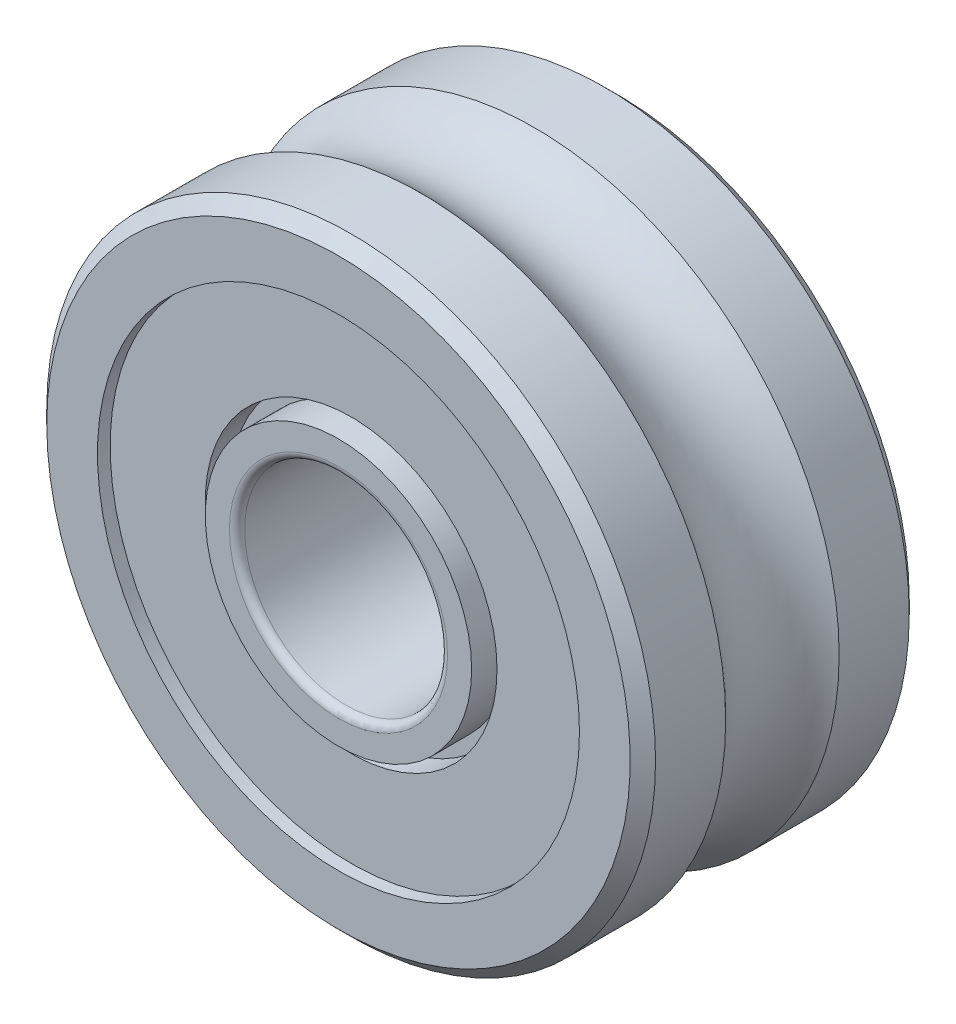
ISO-10303-21;
HEADER;
FILE_DESCRIPTION(('STEP AP214'),'2;1');
FILE_NAME('part.step','',(''),(''),'','','');
FILE_SCHEMA(('AUTOMOTIVE_DESIGN { 1 0 10303 214 1 1 1 1 }'));
ENDSEC;
DATA;
#1=APPLICATION_CONTEXT('core data for automotive mechanical design processes');
#2=APPLICATION_PROTOCOL_DEFINITION('international standard','automotive_design',2000,#1);
#3=PRODUCT_CONTEXT('',#1,'mechanical');
#4=PRODUCT('Part','Part','',(#3));
#5=PRODUCT_RELATED_PRODUCT_CATEGORY('part','',(#4));
#6=PRODUCT_DEFINITION_FORMATION('','',#4);
#7=PRODUCT_DEFINITION_CONTEXT('part definition',#1,'design');
#8=PRODUCT_DEFINITION('design','',#6,#7);
#9=PRODUCT_DEFINITION_SHAPE('','',#8);
#10=(LENGTH_UNIT() NAMED_UNIT(*) SI_UNIT(.MILLI.,.METRE.));
#11=(NAMED_UNIT(*) PLANE_ANGLE_UNIT() SI_UNIT($,.RADIAN.));
#12=(NAMED_UNIT(*) SI_UNIT($,.STERADIAN.) SOLID_ANGLE_UNIT());
#13=UNCERTAINTY_MEASURE_WITH_UNIT(LENGTH_MEASURE(1.E-05),#10,'distance_accuracy_value','');
#14=(GEOMETRIC_REPRESENTATION_CONTEXT(3) GLOBAL_UNCERTAINTY_ASSIGNED_CONTEXT((#13)) GLOBAL_UNIT_ASSIGNED_CONTEXT((#10,
#11,#12)) REPRESENTATION_CONTEXT('',''));
#15=CARTESIAN_POINT('',(0.,0.,0.));
#16=DIRECTION('',(0.,0.,1.));
#17=DIRECTION('',(1.,0.,0.));
#18=AXIS2_PLACEMENT_3D('',#15,#16,#17);
#19=CARTESIAN_POINT('',(0.,0.,38.6779652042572));
#20=DIRECTION('',(0.,0.,1.));
#21=DIRECTION('',(1.,0.,0.));
#22=AXIS2_PLACEMENT_3D('',#19,#20,#21);
#23=CYLINDRICAL_SURFACE('',#22,5.75);
#24=CARTESIAN_POINT('',(0.,0.,-5.));
#25=DIRECTION('',(0.,0.,1.));
#26=DIRECTION('',(1.,0.,0.));
#27=AXIS2_PLACEMENT_3D('',#24,#25,#26);
#28=CIRCLE('',#27,5.75);
#29=CARTESIAN_POINT('',(5.75,0.,-5.));
#30=VERTEX_POINT('',#29);
#31=EDGE_CURVE('E198',#30,#30,#28,.F.);
#32=ORIENTED_EDGE('',*,*,#31,.T.);
#33=EDGE_LOOP('',(#32));
#34=FACE_BOUND('',#33,.T.);
#35=CARTESIAN_POINT('',(0.,0.,-4.));
#36=DIRECTION('',(0.,0.,1.));
#37=DIRECTION('',(1.,0.,0.));
#38=AXIS2_PLACEMENT_3D('',#35,#36,#37);
#39=CIRCLE('',#38,5.75);
#40=CARTESIAN_POINT('',(5.75,0.,-4.));
#41=VERTEX_POINT('',#40);
#42=EDGE_CURVE('E201',#41,#41,#39,.T.);
#43=ORIENTED_EDGE('',*,*,#42,.T.);
#44=EDGE_LOOP('',(#43));
#45=FACE_BOUND('',#44,.T.);
#46=ADVANCED_FACE('F14',(#34,#45),#23,.F.);
#47=CARTESIAN_POINT('',(0.,9.5,-5.));
#48=DIRECTION('',(0.,0.,1.));
#49=DIRECTION('',(1.,0.,0.));
#50=AXIS2_PLACEMENT_3D('',#47,#48,#49);
#51=PLANE('',#50);
#52=ORIENTED_EDGE('',*,*,#31,.F.);
#53=EDGE_LOOP('',(#52));
#54=FACE_BOUND('',#53,.T.);
#55=CARTESIAN_POINT('',(0.,0.,-5.));
#56=DIRECTION('',(0.,0.,1.));
#57=DIRECTION('',(1.,0.,0.));
#58=AXIS2_PLACEMENT_3D('',#55,#56,#57);
#59=CIRCLE('',#58,9.5);
#60=CARTESIAN_POINT('',(9.5,0.,-5.));
#61=VERTEX_POINT('',#60);
#62=EDGE_CURVE('E204',#61,#61,#59,.F.);
#63=ORIENTED_EDGE('',*,*,#62,.T.);
#64=EDGE_LOOP('',(#63));
#65=FACE_BOUND('',#64,.T.);
#66=ADVANCED_FACE('F95',(#54,#65),#51,.F.);
#67=CARTESIAN_POINT('',(0.,5.25,-4.));
#68=DIRECTION('',(0.,0.,1.));
#69=DIRECTION('',(1.,0.,0.));
#70=AXIS2_PLACEMENT_3D('',#67,#68,#69);
#71=PLANE('',#70);
#72=CARTESIAN_POINT('',(0.,0.,-4.));
#73=DIRECTION('',(0.,0.,1.));
#74=DIRECTION('',(1.,0.,0.));
#75=AXIS2_PLACEMENT_3D('',#72,#73,#74);
#76=CIRCLE('',#75,5.25);
#77=CARTESIAN_POINT('',(5.25,0.,-4.));
#78=VERTEX_POINT('',#77);
#79=EDGE_CURVE('E207',#78,#78,#76,.F.);
#80=ORIENTED_EDGE('',*,*,#79,.F.);
#81=EDGE_LOOP('',(#80));
#82=FACE_BOUND('',#81,.T.);
#83=ORIENTED_EDGE('',*,*,#42,.F.);
#84=EDGE_LOOP('',(#83));
#85=FACE_BOUND('',#84,.T.);
#86=ADVANCED_FACE('F92',(#82,#85),#71,.F.);
#87=CARTESIAN_POINT('',(0.,0.,38.6779652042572));
#88=DIRECTION('',(0.,0.,1.));
#89=DIRECTION('',(1.,0.,0.));
#90=AXIS2_PLACEMENT_3D('',#87,#88,#89);
#91=CYLINDRICAL_SURFACE('',#90,9.5);
#92=CARTESIAN_POINT('',(0.,0.,-5.5));
#93=DIRECTION('',(0.,0.,1.));
#94=DIRECTION('',(1.,0.,0.));
#95=AXIS2_PLACEMENT_3D('',#92,#93,#94);
#96=CIRCLE('',#95,9.5);
#97=CARTESIAN_POINT('',(9.5,0.,-5.5));
#98=VERTEX_POINT('',#97);
#99=EDGE_CURVE('E210',#98,#98,#96,.F.);
#100=ORIENTED_EDGE('',*,*,#99,.T.);
#101=EDGE_LOOP('',(#100));
#102=FACE_BOUND('',#101,.T.);
#103=ORIENTED_EDGE('',*,*,#62,.F.);
#104=EDGE_LOOP('',(#103));
#105=FACE_BOUND('',#104,.T.);
#106=ADVANCED_FACE('F88',(#102,#105),#91,.F.);
#107=CARTESIAN_POINT('',(0.,0.,38.6779652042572));
#108=DIRECTION('',(0.,0.,1.));
#109=DIRECTION('',(1.,0.,0.));
#110=AXIS2_PLACEMENT_3D('',#107,#108,#109);
#111=CYLINDRICAL_SURFACE('',#110,5.25);
#112=ORIENTED_EDGE('',*,*,#79,.T.);
#113=EDGE_LOOP('',(#112));
#114=FACE_BOUND('',#113,.T.);
#115=CARTESIAN_POINT('',(0.,0.,-5.5));
#116=DIRECTION('',(0.,0.,1.));
#117=DIRECTION('',(1.,0.,0.));
#118=AXIS2_PLACEMENT_3D('',#115,#116,#117);
#119=CIRCLE('',#118,5.25);
#120=CARTESIAN_POINT('',(5.25,0.,-5.5));
#121=VERTEX_POINT('',#120);
#122=EDGE_CURVE('E213',#121,#121,#119,.T.);
#123=ORIENTED_EDGE('',*,*,#122,.T.);
#124=EDGE_LOOP('',(#123));
#125=FACE_BOUND('',#124,.T.);
#126=ADVANCED_FACE('F84',(#114,#125),#111,.T.);
#127=CARTESIAN_POINT('',(0.,11.5,-5.5));
#128=DIRECTION('',(0.,0.,1.));
#129=DIRECTION('',(1.,0.,0.));
#130=AXIS2_PLACEMENT_3D('',#127,#128,#129);
#131=PLANE('',#130);
#132=ORIENTED_EDGE('',*,*,#99,.F.);
#133=EDGE_LOOP('',(#132));
#134=FACE_BOUND('',#133,.T.);
#135=CARTESIAN_POINT('',(0.,0.,-5.5));
#136=DIRECTION('',(0.,0.,1.));
#137=DIRECTION('',(1.,0.,0.));
#138=AXIS2_PLACEMENT_3D('',#135,#136,#137);
#139=CIRCLE('',#138,11.5);
#140=CARTESIAN_POINT('',(11.5,0.,-5.5));
#141=VERTEX_POINT('',#140);
#142=EDGE_CURVE('E56',#141,#141,#139,.T.);
#143=ORIENTED_EDGE('',*,*,#142,.F.);
#144=EDGE_LOOP('',(#143));
#145=FACE_BOUND('',#144,.T.);
#146=ADVANCED_FACE('F73',(#134,#145),#131,.F.);
#147=CARTESIAN_POINT('',(0.,5.25,-5.5));
#148=DIRECTION('',(0.,0.,1.));
#149=DIRECTION('',(1.,0.,0.));
#150=AXIS2_PLACEMENT_3D('',#147,#148,#149);
#151=PLANE('',#150);
#152=CARTESIAN_POINT('',(0.,0.,-5.5));
#153=DIRECTION('',(0.,0.,-1.));
#154=DIRECTION('',(1.,0.,0.));
#155=AXIS2_PLACEMENT_3D('',#152,#153,#154);
#156=CIRCLE('',#155,4.3);
#157=CARTESIAN_POINT('',(4.3,0.,-5.5));
#158=VERTEX_POINT('',#157);
#159=CARTESIAN_POINT('',(-4.3,0.,-5.5));
#160=VERTEX_POINT('',#159);
#161=EDGE_CURVE('E42',#158,#160,#156,.T.);
#162=ORIENTED_EDGE('',*,*,#161,.F.);
#163=CARTESIAN_POINT('',(0.,0.,-5.5));
#164=DIRECTION('',(0.,0.,-1.));
#165=DIRECTION('',(-1.,0.,0.));
#166=AXIS2_PLACEMENT_3D('',#163,#164,#165);
#167=CIRCLE('',#166,4.3);
#168=EDGE_CURVE('E44',#160,#158,#167,.T.);
#169=ORIENTED_EDGE('',*,*,#168,.F.);
#170=EDGE_LOOP('',(#162,#169));
#171=FACE_BOUND('',#170,.T.);
#172=ORIENTED_EDGE('',*,*,#122,.F.);
#173=EDGE_LOOP('',(#172));
#174=FACE_BOUND('',#173,.T.);
#175=ADVANCED_FACE('F54',(#171,#174),#151,.F.);
#176=CARTESIAN_POINT('',(0.,0.,-5.));
#177=DIRECTION('',(0.,0.,1.));
#178=DIRECTION('',(1.,0.,0.));
#179=AXIS2_PLACEMENT_3D('',#176,#177,#178);
#180=CONICAL_SURFACE('',#179,12.,0.785398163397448);
#181=ORIENTED_EDGE('',*,*,#142,.T.);
#182=EDGE_LOOP('',(#181));
#183=FACE_BOUND('',#182,.T.);
#184=CARTESIAN_POINT('',(0.,0.,-5.));
#185=DIRECTION('',(0.,0.,1.));
#186=DIRECTION('',(1.,0.,0.));
#187=AXIS2_PLACEMENT_3D('',#184,#185,#186);
#188=CIRCLE('',#187,12.);
#189=CARTESIAN_POINT('',(12.,0.,-5.));
#190=VERTEX_POINT('',#189);
#191=EDGE_CURVE('E50',#190,#190,#188,.T.);
#192=ORIENTED_EDGE('',*,*,#191,.F.);
#193=EDGE_LOOP('',(#192));
#194=FACE_BOUND('',#193,.T.);
#195=ADVANCED_FACE('F72',(#183,#194),#180,.T.);
#196=CARTESIAN_POINT('',(0.,0.,-5.2));
#197=DIRECTION('',(0.,0.,1.));
#198=DIRECTION('',(1.,0.,0.));
#199=AXIS2_PLACEMENT_3D('',#196,#197,#198);
#200=TOROIDAL_SURFACE('',#199,4.3,0.3);
#201=ORIENTED_EDGE('',*,*,#161,.T.);
#202=ORIENTED_EDGE('',*,*,#168,.T.);
#203=EDGE_LOOP('',(#201,#202));
#204=FACE_BOUND('',#203,.T.);
#205=CARTESIAN_POINT('',(0.,0.,-5.2));
#206=DIRECTION('',(0.,0.,1.));
#207=DIRECTION('',(1.,0.,0.));
#208=AXIS2_PLACEMENT_3D('',#205,#206,#207);
#209=CIRCLE('',#208,4.);
#210=CARTESIAN_POINT('',(4.,0.,-5.2));
#211=VERTEX_POINT('',#210);
#212=EDGE_CURVE('E247',#211,#211,#209,.T.);
#213=ORIENTED_EDGE('',*,*,#212,.T.);
#214=EDGE_LOOP('',(#213));
#215=FACE_BOUND('',#214,.T.);
#216=ADVANCED_FACE('F46',(#204,#215),#200,.T.);
#217=CARTESIAN_POINT('',(0.,0.,38.6779652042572));
#218=DIRECTION('',(0.,0.,1.));
#219=DIRECTION('',(1.,0.,0.));
#220=AXIS2_PLACEMENT_3D('',#217,#218,#219);
#221=CYLINDRICAL_SURFACE('',#220,12.);
#222=ORIENTED_EDGE('',*,*,#191,.T.);
#223=EDGE_LOOP('',(#222));
#224=FACE_BOUND('',#223,.T.);
#225=CARTESIAN_POINT('',(0.,0.,-2.2360679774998));
#226=DIRECTION('',(0.,0.,1.));
#227=DIRECTION('',(1.,0.,0.));
#228=AXIS2_PLACEMENT_3D('',#225,#226,#227);
#229=CIRCLE('',#228,12.);
#230=CARTESIAN_POINT('',(12.,0.,-2.2360679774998));
#231=VERTEX_POINT('',#230);
#232=EDGE_CURVE('E250',#231,#231,#229,.F.);
#233=ORIENTED_EDGE('',*,*,#232,.T.);
#234=EDGE_LOOP('',(#233));
#235=FACE_BOUND('',#234,.T.);
#236=ADVANCED_FACE('F243',(#224,#235),#221,.T.);
#237=CARTESIAN_POINT('',(0.,0.,38.6779652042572));
#238=DIRECTION('',(0.,0.,1.));
#239=DIRECTION('',(1.,0.,0.));
#240=AXIS2_PLACEMENT_3D('',#237,#238,#239);
#241=CYLINDRICAL_SURFACE('',#240,4.);
#242=ORIENTED_EDGE('',*,*,#212,.F.);
#243=EDGE_LOOP('',(#242));
#244=FACE_BOUND('',#243,.T.);
#245=CARTESIAN_POINT('',(0.,0.,5.2));
#246=DIRECTION('',(0.,0.,1.));
#247=DIRECTION('',(1.,0.,0.));
#248=AXIS2_PLACEMENT_3D('',#245,#246,#247);
#249=CIRCLE('',#248,4.);
#250=CARTESIAN_POINT('',(4.,0.,5.2));
#251=VERTEX_POINT('',#250);
#252=EDGE_CURVE('E252',#251,#251,#249,.F.);
#253=ORIENTED_EDGE('',*,*,#252,.F.);
#254=EDGE_LOOP('',(#253));
#255=FACE_BOUND('',#254,.T.);
#256=ADVANCED_FACE('F179',(#244,#255),#241,.F.);
#257=CARTESIAN_POINT('',(0.,0.,5.2));
#258=DIRECTION('',(0.,0.,1.));
#259=DIRECTION('',(1.,0.,0.));
#260=AXIS2_PLACEMENT_3D('',#257,#258,#259);
#261=TOROIDAL_SURFACE('',#260,4.3,0.3);
#262=ORIENTED_EDGE('',*,*,#252,.T.);
#263=EDGE_LOOP('',(#262));
#264=FACE_BOUND('',#263,.T.);
#265=CARTESIAN_POINT('',(0.,0.,5.5));
#266=DIRECTION('',(0.,0.,1.));
#267=DIRECTION('',(1.,0.,0.));
#268=AXIS2_PLACEMENT_3D('',#265,#266,#267);
#269=CIRCLE('',#268,4.3);
#270=CARTESIAN_POINT('',(4.3,0.,5.5));
#271=VERTEX_POINT('',#270);
#272=CARTESIAN_POINT('',(-4.3,0.,5.5));
#273=VERTEX_POINT('',#272);
#274=EDGE_CURVE('E33',#271,#273,#269,.T.);
#275=ORIENTED_EDGE('',*,*,#274,.T.);
#276=CARTESIAN_POINT('',(0.,0.,5.5));
#277=DIRECTION('',(0.,0.,1.));
#278=DIRECTION('',(-1.,0.,0.));
#279=AXIS2_PLACEMENT_3D('',#276,#277,#278);
#280=CIRCLE('',#279,4.3);
#281=EDGE_CURVE('E197',#273,#271,#280,.T.);
#282=ORIENTED_EDGE('',*,*,#281,.T.);
#283=EDGE_LOOP('',(#275,#282));
#284=FACE_BOUND('',#283,.T.);
#285=ADVANCED_FACE('F175',(#264,#284),#261,.T.);
#286=CARTESIAN_POINT('',(0.,0.,0.));
#287=DIRECTION('',(0.,0.,1.));
#288=DIRECTION('',(1.,0.,0.));
#289=AXIS2_PLACEMENT_3D('',#286,#287,#288);
#290=TOROIDAL_SURFACE('',#289,14.,3.);
#291=ORIENTED_EDGE('',*,*,#232,.F.);
#292=EDGE_LOOP('',(#291));
#293=FACE_BOUND('',#292,.T.);
#294=CARTESIAN_POINT('',(0.,0.,2.23606797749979));
#295=DIRECTION('',(0.,0.,1.));
#296=DIRECTION('',(1.,0.,0.));
#297=AXIS2_PLACEMENT_3D('',#294,#295,#296);
#298=CIRCLE('',#297,12.);
#299=CARTESIAN_POINT('',(12.,0.,2.23606797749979));
#300=VERTEX_POINT('',#299);
#301=EDGE_CURVE('E162',#300,#300,#298,.T.);
#302=ORIENTED_EDGE('',*,*,#301,.F.);
#303=EDGE_LOOP('',(#302));
#304=FACE_BOUND('',#303,.T.);
#305=ADVANCED_FACE('F149',(#293,#304),#290,.F.);
#306=CARTESIAN_POINT('',(0.,5.25,5.5));
#307=DIRECTION('',(0.,0.,-1.));
#308=DIRECTION('',(-1.,0.,0.));
#309=AXIS2_PLACEMENT_3D('',#306,#307,#308);
#310=PLANE('',#309);
#311=CARTESIAN_POINT('',(0.,0.,5.5));
#312=DIRECTION('',(0.,0.,1.));
#313=DIRECTION('',(1.,0.,0.));
#314=AXIS2_PLACEMENT_3D('',#311,#312,#313);
#315=CIRCLE('',#314,5.25);
#316=CARTESIAN_POINT('',(5.25,0.,5.5));
#317=VERTEX_POINT('',#316);
#318=EDGE_CURVE('E169',#317,#317,#315,.F.);
#319=ORIENTED_EDGE('',*,*,#318,.F.);
#320=EDGE_LOOP('',(#319));
#321=FACE_BOUND('',#320,.T.);
#322=ORIENTED_EDGE('',*,*,#281,.F.);
#323=ORIENTED_EDGE('',*,*,#274,.F.);
#324=EDGE_LOOP('',(#322,#323));
#325=FACE_BOUND('',#324,.T.);
#326=ADVANCED_FACE('F144',(#321,#325),#310,.F.);
#327=CARTESIAN_POINT('',(0.,0.,38.6779652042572));
#328=DIRECTION('',(0.,0.,1.));
#329=DIRECTION('',(1.,0.,0.));
#330=AXIS2_PLACEMENT_3D('',#327,#328,#329);
#331=CYLINDRICAL_SURFACE('',#330,12.);
#332=ORIENTED_EDGE('',*,*,#301,.T.);
#333=EDGE_LOOP('',(#332));
#334=FACE_BOUND('',#333,.T.);
#335=CARTESIAN_POINT('',(0.,0.,5.));
#336=DIRECTION('',(0.,0.,-1.));
#337=DIRECTION('',(-1.,0.,0.));
#338=AXIS2_PLACEMENT_3D('',#335,#336,#337);
#339=CIRCLE('',#338,12.);
#340=CARTESIAN_POINT('',(-12.,0.,5.));
#341=VERTEX_POINT('',#340);
#342=EDGE_CURVE('E220',#341,#341,#339,.F.);
#343=ORIENTED_EDGE('',*,*,#342,.F.);
#344=EDGE_LOOP('',(#343));
#345=FACE_BOUND('',#344,.T.);
#346=ADVANCED_FACE('F140',(#334,#345),#331,.T.);
#347=CARTESIAN_POINT('',(0.,0.,38.6779652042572));
#348=DIRECTION('',(0.,0.,1.));
#349=DIRECTION('',(1.,0.,0.));
#350=AXIS2_PLACEMENT_3D('',#347,#348,#349);
#351=CYLINDRICAL_SURFACE('',#350,5.25);
#352=ORIENTED_EDGE('',*,*,#318,.T.);
#353=EDGE_LOOP('',(#352));
#354=FACE_BOUND('',#353,.T.);
#355=CARTESIAN_POINT('',(0.,0.,4.));
#356=DIRECTION('',(0.,0.,1.));
#357=DIRECTION('',(1.,0.,0.));
#358=AXIS2_PLACEMENT_3D('',#355,#356,#357);
#359=CIRCLE('',#358,5.25);
#360=CARTESIAN_POINT('',(5.25,0.,4.));
#361=VERTEX_POINT('',#360);
#362=EDGE_CURVE('E221',#361,#361,#359,.T.);
#363=ORIENTED_EDGE('',*,*,#362,.T.);
#364=EDGE_LOOP('',(#363));
#365=FACE_BOUND('',#364,.T.);
#366=ADVANCED_FACE('F136',(#354,#365),#351,.T.);
#367=CARTESIAN_POINT('',(0.,0.,5.));
#368=DIRECTION('',(0.,0.,-1.));
#369=DIRECTION('',(-1.,0.,0.));
#370=AXIS2_PLACEMENT_3D('',#367,#368,#369);
#371=CONICAL_SURFACE('',#370,12.,0.785398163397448);
#372=CARTESIAN_POINT('',(0.,0.,5.5));
#373=DIRECTION('',(0.,0.,-1.));
#374=DIRECTION('',(-1.,0.,0.));
#375=AXIS2_PLACEMENT_3D('',#372,#373,#374);
#376=CIRCLE('',#375,11.5);
#377=CARTESIAN_POINT('',(-11.5,0.,5.5));
#378=VERTEX_POINT('',#377);
#379=EDGE_CURVE('E224',#378,#378,#376,.T.);
#380=ORIENTED_EDGE('',*,*,#379,.T.);
#381=EDGE_LOOP('',(#380));
#382=FACE_BOUND('',#381,.T.);
#383=ORIENTED_EDGE('',*,*,#342,.T.);
#384=EDGE_LOOP('',(#383));
#385=FACE_BOUND('',#384,.T.);
#386=ADVANCED_FACE('F132',(#382,#385),#371,.T.);
#387=CARTESIAN_POINT('',(0.,5.25,4.));
#388=DIRECTION('',(0.,0.,-1.));
#389=DIRECTION('',(-1.,0.,0.));
#390=AXIS2_PLACEMENT_3D('',#387,#388,#389);
#391=PLANE('',#390);
#392=CARTESIAN_POINT('',(0.,0.,4.));
#393=DIRECTION('',(0.,0.,1.));
#394=DIRECTION('',(1.,0.,0.));
#395=AXIS2_PLACEMENT_3D('',#392,#393,#394);
#396=CIRCLE('',#395,5.75);
#397=CARTESIAN_POINT('',(5.75,0.,4.));
#398=VERTEX_POINT('',#397);
#399=EDGE_CURVE('E227',#398,#398,#396,.T.);
#400=ORIENTED_EDGE('',*,*,#399,.T.);
#401=EDGE_LOOP('',(#400));
#402=FACE_BOUND('',#401,.T.);
#403=ORIENTED_EDGE('',*,*,#362,.F.);
#404=EDGE_LOOP('',(#403));
#405=FACE_BOUND('',#404,.T.);
#406=ADVANCED_FACE('F128',(#402,#405),#391,.F.);
#407=CARTESIAN_POINT('',(0.,11.5,5.5));
#408=DIRECTION('',(0.,0.,-1.));
#409=DIRECTION('',(-1.,0.,0.));
#410=AXIS2_PLACEMENT_3D('',#407,#408,#409);
#411=PLANE('',#410);
#412=ORIENTED_EDGE('',*,*,#379,.F.);
#413=EDGE_LOOP('',(#412));
#414=FACE_BOUND('',#413,.T.);
#415=CARTESIAN_POINT('',(0.,0.,5.5));
#416=DIRECTION('',(0.,0.,1.));
#417=DIRECTION('',(1.,0.,0.));
#418=AXIS2_PLACEMENT_3D('',#415,#416,#417);
#419=CIRCLE('',#418,9.5);
#420=CARTESIAN_POINT('',(9.5,0.,5.5));
#421=VERTEX_POINT('',#420);
#422=EDGE_CURVE('E230',#421,#421,#419,.F.);
#423=ORIENTED_EDGE('',*,*,#422,.T.);
#424=EDGE_LOOP('',(#423));
#425=FACE_BOUND('',#424,.T.);
#426=ADVANCED_FACE('F124',(#414,#425),#411,.F.);
#427=CARTESIAN_POINT('',(0.,0.,38.6779652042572));
#428=DIRECTION('',(0.,0.,1.));
#429=DIRECTION('',(1.,0.,0.));
#430=AXIS2_PLACEMENT_3D('',#427,#428,#429);
#431=CYLINDRICAL_SURFACE('',#430,5.75);
#432=ORIENTED_EDGE('',*,*,#399,.F.);
#433=EDGE_LOOP('',(#432));
#434=FACE_BOUND('',#433,.T.);
#435=CARTESIAN_POINT('',(0.,0.,5.));
#436=DIRECTION('',(0.,0.,1.));
#437=DIRECTION('',(1.,0.,0.));
#438=AXIS2_PLACEMENT_3D('',#435,#436,#437);
#439=CIRCLE('',#438,5.75);
#440=CARTESIAN_POINT('',(5.75,0.,5.));
#441=VERTEX_POINT('',#440);
#442=EDGE_CURVE('E25',#441,#441,#439,.T.);
#443=ORIENTED_EDGE('',*,*,#442,.T.);
#444=EDGE_LOOP('',(#443));
#445=FACE_BOUND('',#444,.T.);
#446=ADVANCED_FACE('F116',(#434,#445),#431,.F.);
#447=CARTESIAN_POINT('',(0.,0.,38.6779652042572));
#448=DIRECTION('',(0.,0.,1.));
#449=DIRECTION('',(1.,0.,0.));
#450=AXIS2_PLACEMENT_3D('',#447,#448,#449);
#451=CYLINDRICAL_SURFACE('',#450,9.5);
#452=CARTESIAN_POINT('',(0.,0.,5.));
#453=DIRECTION('',(0.,0.,1.));
#454=DIRECTION('',(1.,0.,0.));
#455=AXIS2_PLACEMENT_3D('',#452,#453,#454);
#456=CIRCLE('',#455,9.5);
#457=CARTESIAN_POINT('',(9.5,0.,5.));
#458=VERTEX_POINT('',#457);
#459=EDGE_CURVE('E9',#458,#458,#456,.F.);
#460=ORIENTED_EDGE('',*,*,#459,.T.);
#461=EDGE_LOOP('',(#460));
#462=FACE_BOUND('',#461,.T.);
#463=ORIENTED_EDGE('',*,*,#422,.F.);
#464=EDGE_LOOP('',(#463));
#465=FACE_BOUND('',#464,.T.);
#466=ADVANCED_FACE('F109',(#462,#465),#451,.F.);
#467=CARTESIAN_POINT('',(0.,9.5,5.));
#468=DIRECTION('',(0.,0.,-1.));
#469=DIRECTION('',(-1.,0.,0.));
#470=AXIS2_PLACEMENT_3D('',#467,#468,#469);
#471=PLANE('',#470);
#472=ORIENTED_EDGE('',*,*,#459,.F.);
#473=EDGE_LOOP('',(#472));
#474=FACE_BOUND('',#473,.T.);
#475=ORIENTED_EDGE('',*,*,#442,.F.);
#476=EDGE_LOOP('',(#475));
#477=FACE_BOUND('',#476,.T.);
#478=ADVANCED_FACE('F107',(#474,#477),#471,.F.);
#479=CLOSED_SHELL('',(#46,#66,#86,#106,#126,#146,#175,#195,#216,#236,#256,#285,#305,#326,#346,
#366,#386,#406,#426,#446,#466,#478));
#480=MANIFOLD_SOLID_BREP('B1',#479);
#481=ADVANCED_BREP_SHAPE_REPRESENTATION('',(#18,#480),#14);
#482=SHAPE_DEFINITION_REPRESENTATION(#9,#481);
ENDSEC;
END-ISO-10303-21;
